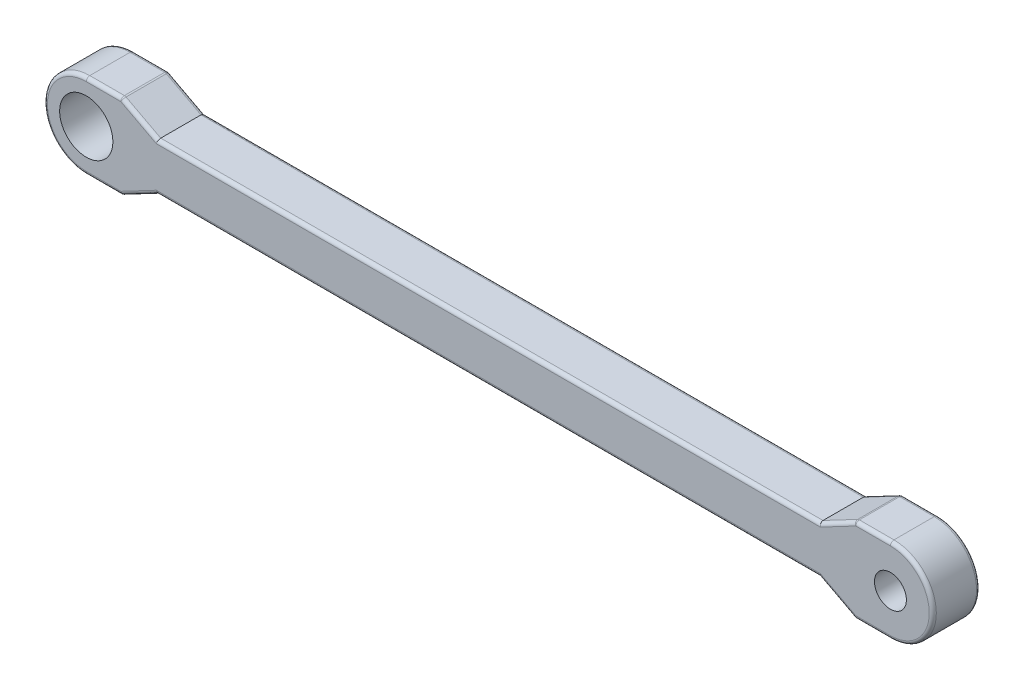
from build123d import *

# Parameters (mm, degrees)
SKETCH1_R           = 3.048
BOSS_EXTRUDE1_DEPTH = 5.08
CUT_EXTRUDE1_DEPTH  = 49.21257811
FILLET1_R           = 0.381
BOSS_EXTRUDE2_START = -5.08
SKETCH3_R           = 3.048
BOSS_EXTRUDE2_DEPTH = 5.08
SKETCH4_R           = 1.7145
CUT_EXTRUDE2_DEPTH  = 49.212578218
SKETCH5_R           = 2.8575
CUT_EXTRUDE3_DEPTH  = 49.212578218


with BuildPart() as part:
    # Sketch1 → Boss-Extrude1 (new body)
    with BuildSketch(Plane.XY):
        with BuildLine():
            Line((-43.18, 4.548), (43.18, 4.548))
            ThreePointArc((43.18, 4.548), (47.728, 0), (43.18, -4.548))
            Line((43.18, -4.548), (-43.18, -4.548))
            ThreePointArc((-43.18, -4.548), (-47.728, 0), (-43.18, 4.548))
        make_face()
        with Locations((-43.18, 0)):
            Circle(SKETCH1_R, mode=Mode.SUBTRACT)
        with Locations((43.18, 0)):
            Circle(SKETCH1_R, mode=Mode.SUBTRACT)
    extrude(amount=BOSS_EXTRUDE1_DEPTH)

    # Sketch2 → Cut-Extrude1 (cut, through all)
    with BuildSketch(Plane.XY):
        Polygon((-39.37, 4.548), (-35.56, 2.54), (35.56, 2.54), (39.37, 4.548), align=None)
        Polygon((-35.56, -2.54), (35.56, -2.54), (39.37, -4.548), (-39.37, -4.548), align=None)
    extrude(amount=CUT_EXTRUDE1_DEPTH, mode=Mode.SUBTRACT)

    # Fillet1
    fillet1_edges = [part.edges().sort_by_distance(p)[0] for p in [
        (47.728, 0, 5.08),
        (41.275, 4.548, 5.08),
        (-41.275, 4.548, 0),
        (-41.275, 4.548, 5.08),
        (39.37, 4.548, 2.54),
        (-37.465, 3.544, 0),
        (-39.37, 4.548, 2.54),
        (0, 2.54, 0),
        (37.465, 3.544, 0),
        (-37.465, 3.544, 5.08),
        (0, 2.54, 5.08),
        (37.465, 3.544, 5.08),
        (41.275, -4.548, 0),
        (41.275, -4.548, 5.08),
        (-47.728, 0, 5.08),
        (-37.465, -3.544, 0),
        (-39.37, -4.548, 2.54),
        (37.465, -3.544, 0),
        (39.37, -4.548, 2.54),
        (0, -2.54, 0),
        (-37.465, -3.544, 5.08),
        (37.465, -3.544, 5.08),
        (0, -2.54, 5.08),
        (41.275, 4.548, 0),
        (47.728, 0, 0),
        (-41.275, -4.548, 0),
        (-47.728, 0, 0),
        (-41.275, -4.548, 5.08),
    ]]
    fillet(fillet1_edges, radius=FILLET1_R)

    # Sketch3 → Boss-Extrude2 (add)
    with BuildSketch(Plane.XY.offset(5.08).offset(BOSS_EXTRUDE2_START)):
        with Locations((-43.18, 0)):
            Circle(SKETCH3_R)
    boss_extrude2 = extrude(amount=BOSS_EXTRUDE2_DEPTH)

    # Mirror1: Boss-Extrude2 across plane
    add(boss_extrude2.mirror(Plane(origin=(0, 0, 0), x_dir=(0, 0, 1), z_dir=(1, 0, 0))))

    # Sketch4 → Cut-Extrude2 (cut, through all)
    with BuildSketch(Plane.XY.offset(5.08)):
        with Locations((-43.18, 0)):
            Circle(SKETCH4_R)
    cut_extrude2 = extrude(amount=-CUT_EXTRUDE2_DEPTH, mode=Mode.SUBTRACT)

    # Mirror2: Cut-Extrude2 across plane
    add(cut_extrude2.mirror(Plane(origin=(0, 0, 0), x_dir=(0, 0, 1), z_dir=(1, 0, 0))), mode=Mode.SUBTRACT)

    # Sketch5 → Cut-Extrude3 (cut, through all)
    with BuildSketch(Plane.XY.offset(5.08)):
        with Locations((-43.18, 0)):
            Circle(SKETCH5_R)
    extrude(amount=-CUT_EXTRUDE3_DEPTH, mode=Mode.SUBTRACT)


solid = part.part
